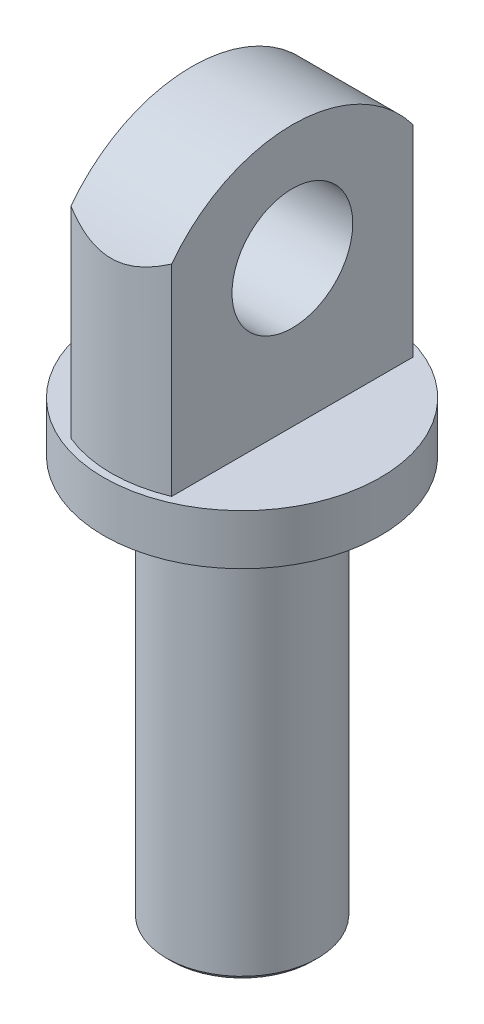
ISO-10303-21;
HEADER;
FILE_DESCRIPTION(('STEP AP214'),'2;1');
FILE_NAME('part.step','',(''),(''),'','','');
FILE_SCHEMA(('AUTOMOTIVE_DESIGN { 1 0 10303 214 1 1 1 1 }'));
ENDSEC;
DATA;
#1=APPLICATION_CONTEXT('core data for automotive mechanical design processes');
#2=APPLICATION_PROTOCOL_DEFINITION('international standard','automotive_design',2000,#1);
#3=PRODUCT_CONTEXT('',#1,'mechanical');
#4=PRODUCT('Part','Part','',(#3));
#5=PRODUCT_RELATED_PRODUCT_CATEGORY('part','',(#4));
#6=PRODUCT_DEFINITION_FORMATION('','',#4);
#7=PRODUCT_DEFINITION_CONTEXT('part definition',#1,'design');
#8=PRODUCT_DEFINITION('design','',#6,#7);
#9=PRODUCT_DEFINITION_SHAPE('','',#8);
#10=(LENGTH_UNIT() NAMED_UNIT(*) SI_UNIT(.MILLI.,.METRE.));
#11=(NAMED_UNIT(*) PLANE_ANGLE_UNIT() SI_UNIT($,.RADIAN.));
#12=(NAMED_UNIT(*) SI_UNIT($,.STERADIAN.) SOLID_ANGLE_UNIT());
#13=UNCERTAINTY_MEASURE_WITH_UNIT(LENGTH_MEASURE(1.E-05),#10,'distance_accuracy_value','');
#14=(GEOMETRIC_REPRESENTATION_CONTEXT(3) GLOBAL_UNCERTAINTY_ASSIGNED_CONTEXT((#13)) GLOBAL_UNIT_ASSIGNED_CONTEXT((#10,
#11,#12)) REPRESENTATION_CONTEXT('',''));
#15=CARTESIAN_POINT('',(0.,0.,0.));
#16=DIRECTION('',(0.,0.,1.));
#17=DIRECTION('',(1.,0.,0.));
#18=AXIS2_PLACEMENT_3D('',#15,#16,#17);
#19=CARTESIAN_POINT('',(0.,90.,0.));
#20=DIRECTION('',(0.,1.,0.));
#21=DIRECTION('',(0.,0.,1.));
#22=AXIS2_PLACEMENT_3D('',#19,#20,#21);
#23=PLANE('',#22);
#24=CARTESIAN_POINT('',(0.,90.,0.));
#25=DIRECTION('',(0.,1.,0.));
#26=DIRECTION('',(0.,0.,1.));
#27=AXIS2_PLACEMENT_3D('',#24,#25,#26);
#28=CIRCLE('',#27,27.5);
#29=CARTESIAN_POINT('',(0.,90.,27.5));
#30=VERTEX_POINT('',#29);
#31=EDGE_CURVE('E99',#30,#30,#28,.T.);
#32=ORIENTED_EDGE('',*,*,#31,.T.);
#33=EDGE_LOOP('',(#32));
#34=FACE_BOUND('',#33,.T.);
#35=DIRECTION('',(0.,0.,1.));
#36=VECTOR('',#35,1.);
#37=CARTESIAN_POINT('',(-9.99999999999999,90.,-24.));
#38=LINE('',#37,#36);
#39=CARTESIAN_POINT('',(-9.99999999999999,90.,-24.));
#40=VERTEX_POINT('',#39);
#41=CARTESIAN_POINT('',(-9.99999999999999,90.,24.));
#42=VERTEX_POINT('',#41);
#43=EDGE_CURVE('E247',#40,#42,#38,.T.);
#44=ORIENTED_EDGE('',*,*,#43,.F.);
#45=CARTESIAN_POINT('',(0.,90.,0.));
#46=DIRECTION('',(0.,1.,0.));
#47=DIRECTION('',(0.,0.,1.));
#48=AXIS2_PLACEMENT_3D('',#45,#46,#47);
#49=CIRCLE('',#48,26.);
#50=CARTESIAN_POINT('',(9.99999999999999,90.,-24.));
#51=VERTEX_POINT('',#50);
#52=EDGE_CURVE('E245',#51,#40,#49,.T.);
#53=ORIENTED_EDGE('',*,*,#52,.F.);
#54=DIRECTION('',(0.,0.,-1.));
#55=VECTOR('',#54,1.);
#56=CARTESIAN_POINT('',(9.99999999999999,90.,-24.));
#57=LINE('',#56,#55);
#58=CARTESIAN_POINT('',(9.99999999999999,90.,24.));
#59=VERTEX_POINT('',#58);
#60=EDGE_CURVE('E87',#59,#51,#57,.T.);
#61=ORIENTED_EDGE('',*,*,#60,.F.);
#62=CARTESIAN_POINT('',(0.,90.,0.));
#63=DIRECTION('',(0.,1.,0.));
#64=DIRECTION('',(0.,0.,1.));
#65=AXIS2_PLACEMENT_3D('',#62,#63,#64);
#66=CIRCLE('',#65,26.);
#67=EDGE_CURVE('E92',#42,#59,#66,.T.);
#68=ORIENTED_EDGE('',*,*,#67,.F.);
#69=EDGE_LOOP('',(#44,#53,#61,#68));
#70=FACE_BOUND('',#69,.T.);
#71=ADVANCED_FACE('F32',(#34,#70),#23,.T.);
#72=CARTESIAN_POINT('',(0.,80.,0.));
#73=DIRECTION('',(0.,-1.,0.));
#74=DIRECTION('',(0.,0.,-1.));
#75=AXIS2_PLACEMENT_3D('',#72,#73,#74);
#76=CYLINDRICAL_SURFACE('',#75,15.);
#77=CARTESIAN_POINT('',(0.,0.999999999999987,0.));
#78=DIRECTION('',(0.,1.,0.));
#79=DIRECTION('',(0.,0.,1.));
#80=AXIS2_PLACEMENT_3D('',#77,#78,#79);
#81=CIRCLE('',#80,15.);
#82=CARTESIAN_POINT('',(0.,0.999999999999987,15.));
#83=VERTEX_POINT('',#82);
#84=EDGE_CURVE('E40',#83,#83,#81,.T.);
#85=ORIENTED_EDGE('',*,*,#84,.T.);
#86=EDGE_LOOP('',(#85));
#87=FACE_BOUND('',#86,.T.);
#88=CARTESIAN_POINT('',(0.,80.,0.));
#89=DIRECTION('',(0.,1.,0.));
#90=DIRECTION('',(0.,0.,1.));
#91=AXIS2_PLACEMENT_3D('',#88,#89,#90);
#92=CIRCLE('',#91,15.);
#93=CARTESIAN_POINT('',(0.,80.,15.));
#94=VERTEX_POINT('',#93);
#95=EDGE_CURVE('E102',#94,#94,#92,.T.);
#96=ORIENTED_EDGE('',*,*,#95,.F.);
#97=EDGE_LOOP('',(#96));
#98=FACE_BOUND('',#97,.T.);
#99=ADVANCED_FACE('F109',(#87,#98),#76,.T.);
#100=CARTESIAN_POINT('',(0.,0.,0.));
#101=DIRECTION('',(0.,1.,0.));
#102=DIRECTION('',(0.,0.,1.));
#103=AXIS2_PLACEMENT_3D('',#100,#101,#102);
#104=PLANE('',#103);
#105=CARTESIAN_POINT('',(0.,0.,0.));
#106=DIRECTION('',(0.,1.,0.));
#107=DIRECTION('',(0.,0.,1.));
#108=AXIS2_PLACEMENT_3D('',#105,#106,#107);
#109=CIRCLE('',#108,14.);
#110=CARTESIAN_POINT('',(0.,0.,14.));
#111=VERTEX_POINT('',#110);
#112=EDGE_CURVE('E11',#111,#111,#109,.F.);
#113=ORIENTED_EDGE('',*,*,#112,.T.);
#114=EDGE_LOOP('',(#113));
#115=FACE_BOUND('',#114,.T.);
#116=ADVANCED_FACE('F126',(#115),#104,.F.);
#117=CARTESIAN_POINT('',(0.,80.,0.));
#118=DIRECTION('',(0.,1.,0.));
#119=DIRECTION('',(0.,0.,1.));
#120=AXIS2_PLACEMENT_3D('',#117,#118,#119);
#121=PLANE('',#120);
#122=CARTESIAN_POINT('',(0.,80.,0.));
#123=DIRECTION('',(0.,1.,0.));
#124=DIRECTION('',(0.,0.,1.));
#125=AXIS2_PLACEMENT_3D('',#122,#123,#124);
#126=CIRCLE('',#125,27.5);
#127=CARTESIAN_POINT('',(0.,80.,27.5));
#128=VERTEX_POINT('',#127);
#129=EDGE_CURVE('E98',#128,#128,#126,.T.);
#130=ORIENTED_EDGE('',*,*,#129,.F.);
#131=EDGE_LOOP('',(#130));
#132=FACE_BOUND('',#131,.T.);
#133=ORIENTED_EDGE('',*,*,#95,.T.);
#134=EDGE_LOOP('',(#133));
#135=FACE_BOUND('',#134,.T.);
#136=ADVANCED_FACE('F132',(#132,#135),#121,.F.);
#137=CARTESIAN_POINT('',(0.,90.,0.));
#138=DIRECTION('',(0.,-1.,0.));
#139=DIRECTION('',(0.,0.,-1.));
#140=AXIS2_PLACEMENT_3D('',#137,#138,#139);
#141=CYLINDRICAL_SURFACE('',#140,27.5);
#142=ORIENTED_EDGE('',*,*,#31,.F.);
#143=EDGE_LOOP('',(#142));
#144=FACE_BOUND('',#143,.T.);
#145=ORIENTED_EDGE('',*,*,#129,.T.);
#146=EDGE_LOOP('',(#145));
#147=FACE_BOUND('',#146,.T.);
#148=ADVANCED_FACE('F135',(#144,#147),#141,.T.);
#149=CARTESIAN_POINT('',(0.,142.,0.));
#150=DIRECTION('',(0.,-1.,0.));
#151=DIRECTION('',(0.,0.,-1.));
#152=AXIS2_PLACEMENT_3D('',#149,#150,#151);
#153=CYLINDRICAL_SURFACE('',#152,26.);
#154=DIRECTION('',(0.,-1.,0.));
#155=VECTOR('',#154,1.);
#156=CARTESIAN_POINT('',(-9.99999999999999,142.,-24.));
#157=LINE('',#156,#155);
#158=CARTESIAN_POINT('',(-10.,130.,-24.));
#159=VERTEX_POINT('',#158);
#160=EDGE_CURVE('E80',#159,#40,#157,.T.);
#161=ORIENTED_EDGE('',*,*,#160,.F.);
#162=CARTESIAN_POINT('',(-9.99999999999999,130.,-24.));
#163=CARTESIAN_POINT('',(-9.61721305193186,129.78746030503,-24.1594549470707));
#164=CARTESIAN_POINT('',(-9.22821241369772,129.579676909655,-24.3108286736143));
#165=CARTESIAN_POINT('',(-8.43659301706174,129.1772698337,-24.5967847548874));
#166=CARTESIAN_POINT('',(-8.03395311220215,128.982668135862,-24.7313393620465));
#167=CARTESIAN_POINT('',(-7.20815781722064,128.607835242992,-24.9846349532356));
#168=CARTESIAN_POINT('',(-6.78477019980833,128.427904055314,-25.1030687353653));
#169=CARTESIAN_POINT('',(-5.92395259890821,128.091499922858,-25.3200248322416));
#170=CARTESIAN_POINT('',(-5.48653042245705,127.935014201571,-25.4185580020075));
#171=CARTESIAN_POINT('',(-4.66663132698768,127.673251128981,-25.580640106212));
#172=CARTESIAN_POINT('',(-4.28609931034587,127.563797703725,-25.6472416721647));
#173=CARTESIAN_POINT('',(-3.51622672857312,127.369619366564,-25.7640772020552));
#174=CARTESIAN_POINT('',(-3.12688633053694,127.284893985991,-25.8143114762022));
#175=CARTESIAN_POINT('',(-2.344485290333,127.144300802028,-25.8970422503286));
#176=CARTESIAN_POINT('',(-1.95148261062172,127.088198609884,-25.9296829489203));
#177=CARTESIAN_POINT('',(-1.16122908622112,127.006468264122,-25.9770702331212));
#178=CARTESIAN_POINT('',(-0.763978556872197,126.980837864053,-25.9918181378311));
#179=CARTESIAN_POINT('',(0.0331704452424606,126.961341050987,-26.0030462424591));
#180=CARTESIAN_POINT('',(0.43307314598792,126.967602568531,-25.9994528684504));
#181=CARTESIAN_POINT('',(1.2305214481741,127.01184951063,-25.9739292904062));
#182=CARTESIAN_POINT('',(1.62806691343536,127.049836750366,-25.9519980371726));
#183=CARTESIAN_POINT('',(2.42115179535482,127.156059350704,-25.890106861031));
#184=CARTESIAN_POINT('',(2.81664386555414,127.224554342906,-25.849992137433));
#185=CARTESIAN_POINT('',(3.59971643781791,127.388672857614,-25.7526271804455));
#186=CARTESIAN_POINT('',(3.9872967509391,127.484297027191,-25.6953765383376));
#187=CARTESIAN_POINT('',(4.87800387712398,127.733953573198,-25.5435000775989));
#188=CARTESIAN_POINT('',(5.3775986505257,127.896864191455,-25.4427743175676));
#189=CARTESIAN_POINT('',(6.35922069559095,128.255164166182,-25.2153649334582));
#190=CARTESIAN_POINT('',(6.84122952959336,128.450586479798,-25.0886549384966));
#191=CARTESIAN_POINT('',(7.77934610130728,128.862491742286,-24.8136379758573));
#192=CARTESIAN_POINT('',(8.23575378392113,129.078563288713,-24.6657318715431));
#193=CARTESIAN_POINT('',(8.90724657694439,129.415560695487,-24.4277945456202));
#194=CARTESIAN_POINT('',(9.1286234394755,129.529891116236,-24.3459143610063));
#195=CARTESIAN_POINT('',(9.56731334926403,129.762290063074,-24.1768838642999));
#196=CARTESIAN_POINT('',(9.78462710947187,129.880357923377,-24.0897344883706));
#197=CARTESIAN_POINT('',(9.99999999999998,130.,-24.));
#198=B_SPLINE_CURVE_WITH_KNOTS('',3,(#162,#163,#164,#165,#166,#167,#168,#169,#170,#171,#172,
#173,#174,#175,#176,#177,#178,#179,#180,#181,#182,#183,#184,#185,#186,#187,#188,#189,#190,#191,
#192,#193,#194,#195,#196,#197),.UNSPECIFIED.,.F.,.F.,(4,2,2,2,2,2,2,2,2,2,2,2,2,2,2,2,2,4),(0.,
1.39801943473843,2.7983156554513,4.22238146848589,5.6456683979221,6.84918942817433,
8.0526876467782,9.24616580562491,10.4395559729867,11.6377370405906,12.8359866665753,
14.0446346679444,15.2533114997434,16.8561025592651,18.460528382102,20.0378589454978,
20.8245668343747,21.611135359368),.UNSPECIFIED.);
#199=CARTESIAN_POINT('',(9.99999999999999,130.,-24.));
#200=VERTEX_POINT('',#199);
#201=EDGE_CURVE('E75',#159,#200,#198,.T.);
#202=ORIENTED_EDGE('',*,*,#201,.T.);
#203=DIRECTION('',(0.,-1.,0.));
#204=VECTOR('',#203,1.);
#205=CARTESIAN_POINT('',(9.99999999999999,142.,-24.));
#206=LINE('',#205,#204);
#207=EDGE_CURVE('E79',#200,#51,#206,.T.);
#208=ORIENTED_EDGE('',*,*,#207,.T.);
#209=ORIENTED_EDGE('',*,*,#52,.T.);
#210=EDGE_LOOP('',(#161,#202,#208,#209));
#211=FACE_BOUND('',#210,.T.);
#212=ADVANCED_FACE('F76',(#211),#153,.T.);
#213=CARTESIAN_POINT('',(-9.99999999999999,142.,-24.));
#214=DIRECTION('',(1.,0.,0.));
#215=DIRECTION('',(0.,0.,-1.));
#216=AXIS2_PLACEMENT_3D('',#213,#214,#215);
#217=PLANE('',#216);
#218=CARTESIAN_POINT('',(-10.,119.,0.));
#219=DIRECTION('',(1.,0.,0.));
#220=DIRECTION('',(0.,0.,-1.));
#221=AXIS2_PLACEMENT_3D('',#218,#219,#220);
#222=CIRCLE('',#221,12.);
#223=CARTESIAN_POINT('',(-10.,119.,-12.));
#224=VERTEX_POINT('',#223);
#225=EDGE_CURVE('E242',#224,#224,#222,.T.);
#226=ORIENTED_EDGE('',*,*,#225,.T.);
#227=EDGE_LOOP('',(#226));
#228=FACE_BOUND('',#227,.T.);
#229=DIRECTION('',(0.,-1.,0.));
#230=VECTOR('',#229,1.);
#231=CARTESIAN_POINT('',(-9.99999999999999,142.,24.));
#232=LINE('',#231,#230);
#233=CARTESIAN_POINT('',(-9.99999999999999,130.,24.));
#234=VERTEX_POINT('',#233);
#235=EDGE_CURVE('E90',#234,#42,#232,.T.);
#236=ORIENTED_EDGE('',*,*,#235,.F.);
#237=CARTESIAN_POINT('',(-10.,112.,0.));
#238=DIRECTION('',(1.,0.,0.));
#239=DIRECTION('',(0.,0.,-1.));
#240=AXIS2_PLACEMENT_3D('',#237,#238,#239);
#241=CIRCLE('',#240,30.);
#242=EDGE_CURVE('E235',#234,#159,#241,.F.);
#243=ORIENTED_EDGE('',*,*,#242,.T.);
#244=ORIENTED_EDGE('',*,*,#160,.T.);
#245=ORIENTED_EDGE('',*,*,#43,.T.);
#246=EDGE_LOOP('',(#236,#243,#244,#245));
#247=FACE_BOUND('',#246,.T.);
#248=ADVANCED_FACE('F161',(#228,#247),#217,.F.);
#249=CARTESIAN_POINT('',(0.,142.,0.));
#250=DIRECTION('',(0.,-1.,0.));
#251=DIRECTION('',(0.,0.,-1.));
#252=AXIS2_PLACEMENT_3D('',#249,#250,#251);
#253=CYLINDRICAL_SURFACE('',#252,26.);
#254=DIRECTION('',(0.,-1.,0.));
#255=VECTOR('',#254,1.);
#256=CARTESIAN_POINT('',(9.99999999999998,142.,24.));
#257=LINE('',#256,#255);
#258=CARTESIAN_POINT('',(9.99999999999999,130.,24.));
#259=VERTEX_POINT('',#258);
#260=EDGE_CURVE('E54',#259,#59,#257,.T.);
#261=ORIENTED_EDGE('',*,*,#260,.F.);
#262=CARTESIAN_POINT('',(9.99999999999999,130.,24.));
#263=CARTESIAN_POINT('',(9.61721305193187,129.78746030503,24.1594549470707));
#264=CARTESIAN_POINT('',(9.22821241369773,129.579676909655,24.3108286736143));
#265=CARTESIAN_POINT('',(8.43659301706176,129.1772698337,24.5967847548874));
#266=CARTESIAN_POINT('',(8.03395311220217,128.982668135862,24.7313393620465));
#267=CARTESIAN_POINT('',(7.20815781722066,128.607835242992,24.9846349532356));
#268=CARTESIAN_POINT('',(6.78477019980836,128.427904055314,25.1030687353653));
#269=CARTESIAN_POINT('',(5.92395259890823,128.091499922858,25.3200248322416));
#270=CARTESIAN_POINT('',(5.48653042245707,127.935014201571,25.4185580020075));
#271=CARTESIAN_POINT('',(4.66663132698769,127.673251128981,25.580640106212));
#272=CARTESIAN_POINT('',(4.28609931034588,127.563797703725,25.6472416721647));
#273=CARTESIAN_POINT('',(3.51622672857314,127.369619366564,25.7640772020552));
#274=CARTESIAN_POINT('',(3.12688633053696,127.284893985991,25.8143114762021));
#275=CARTESIAN_POINT('',(2.34448529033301,127.144300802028,25.8970422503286));
#276=CARTESIAN_POINT('',(1.95148261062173,127.088198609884,25.9296829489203));
#277=CARTESIAN_POINT('',(1.16122908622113,127.006468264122,25.9770702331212));
#278=CARTESIAN_POINT('',(0.763978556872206,126.980837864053,25.9918181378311));
#279=CARTESIAN_POINT('',(-0.0331704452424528,126.961341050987,26.0030462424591));
#280=CARTESIAN_POINT('',(-0.433073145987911,126.967602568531,25.9994528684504));
#281=CARTESIAN_POINT('',(-1.23052144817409,127.01184951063,25.9739292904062));
#282=CARTESIAN_POINT('',(-1.62806691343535,127.049836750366,25.9519980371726));
#283=CARTESIAN_POINT('',(-2.42115179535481,127.156059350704,25.890106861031));
#284=CARTESIAN_POINT('',(-2.81664386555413,127.224554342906,25.849992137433));
#285=CARTESIAN_POINT('',(-3.5997164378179,127.388672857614,25.7526271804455));
#286=CARTESIAN_POINT('',(-3.98729675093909,127.484297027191,25.6953765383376));
#287=CARTESIAN_POINT('',(-4.87800387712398,127.733953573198,25.5435000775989));
#288=CARTESIAN_POINT('',(-5.37759865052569,127.896864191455,25.4427743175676));
#289=CARTESIAN_POINT('',(-6.35922069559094,128.255164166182,25.2153649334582));
#290=CARTESIAN_POINT('',(-6.84122952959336,128.450586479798,25.0886549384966));
#291=CARTESIAN_POINT('',(-7.77934610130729,128.862491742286,24.8136379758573));
#292=CARTESIAN_POINT('',(-8.23575378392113,129.078563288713,24.6657318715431));
#293=CARTESIAN_POINT('',(-8.90724657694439,129.415560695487,24.4277945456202));
#294=CARTESIAN_POINT('',(-9.1286234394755,129.529891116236,24.3459143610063));
#295=CARTESIAN_POINT('',(-9.56731334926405,129.762290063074,24.1768838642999));
#296=CARTESIAN_POINT('',(-9.78462710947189,129.880357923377,24.0897344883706));
#297=CARTESIAN_POINT('',(-9.99999999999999,130.,24.));
#298=B_SPLINE_CURVE_WITH_KNOTS('',3,(#262,#263,#264,#265,#266,#267,#268,#269,#270,#271,#272,
#273,#274,#275,#276,#277,#278,#279,#280,#281,#282,#283,#284,#285,#286,#287,#288,#289,#290,#291,
#292,#293,#294,#295,#296,#297),.UNSPECIFIED.,.F.,.F.,(4,2,2,2,2,2,2,2,2,2,2,2,2,2,2,2,2,4),(0.,
1.39801943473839,2.79831565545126,4.22238146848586,5.64566839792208,6.8491894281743,
8.05268764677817,9.2461658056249,10.4395559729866,11.6377370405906,12.8359866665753,
14.0446346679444,15.2533114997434,16.8561025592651,18.460528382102,20.0378589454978,
20.8245668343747,21.611135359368),.UNSPECIFIED.);
#299=EDGE_CURVE('E47',#259,#234,#298,.T.);
#300=ORIENTED_EDGE('',*,*,#299,.T.);
#301=ORIENTED_EDGE('',*,*,#235,.T.);
#302=ORIENTED_EDGE('',*,*,#67,.T.);
#303=EDGE_LOOP('',(#261,#300,#301,#302));
#304=FACE_BOUND('',#303,.T.);
#305=ADVANCED_FACE('F167',(#304),#253,.T.);
#306=CARTESIAN_POINT('',(9.99999999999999,142.,-24.));
#307=DIRECTION('',(-1.,0.,0.));
#308=DIRECTION('',(0.,0.,1.));
#309=AXIS2_PLACEMENT_3D('',#306,#307,#308);
#310=PLANE('',#309);
#311=CARTESIAN_POINT('',(9.99999999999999,119.,0.));
#312=DIRECTION('',(1.,0.,0.));
#313=DIRECTION('',(0.,0.,-1.));
#314=AXIS2_PLACEMENT_3D('',#311,#312,#313);
#315=CIRCLE('',#314,12.);
#316=CARTESIAN_POINT('',(9.99999999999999,119.,-12.));
#317=VERTEX_POINT('',#316);
#318=EDGE_CURVE('E240',#317,#317,#315,.T.);
#319=ORIENTED_EDGE('',*,*,#318,.F.);
#320=EDGE_LOOP('',(#319));
#321=FACE_BOUND('',#320,.T.);
#322=ORIENTED_EDGE('',*,*,#207,.F.);
#323=CARTESIAN_POINT('',(9.99999999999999,112.,0.));
#324=DIRECTION('',(-1.,0.,0.));
#325=DIRECTION('',(0.,0.,1.));
#326=AXIS2_PLACEMENT_3D('',#323,#324,#325);
#327=CIRCLE('',#326,30.);
#328=EDGE_CURVE('E81',#259,#200,#327,.T.);
#329=ORIENTED_EDGE('',*,*,#328,.F.);
#330=ORIENTED_EDGE('',*,*,#260,.T.);
#331=ORIENTED_EDGE('',*,*,#60,.T.);
#332=EDGE_LOOP('',(#322,#329,#330,#331));
#333=FACE_BOUND('',#332,.T.);
#334=ADVANCED_FACE('F85',(#321,#333),#310,.F.);
#335=CARTESIAN_POINT('',(-42.,119.,0.));
#336=DIRECTION('',(1.,0.,0.));
#337=DIRECTION('',(0.,0.,-1.));
#338=AXIS2_PLACEMENT_3D('',#335,#336,#337);
#339=CYLINDRICAL_SURFACE('',#338,12.);
#340=CARTESIAN_POINT('',(9.99999999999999,119.,-12.));
#341=CARTESIAN_POINT('',(9.79166666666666,119.,-12.));
#342=CARTESIAN_POINT('',(9.58333333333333,119.,-12.));
#343=CARTESIAN_POINT('',(9.16666666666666,119.,-12.));
#344=CARTESIAN_POINT('',(8.95833333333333,119.,-12.));
#345=CARTESIAN_POINT('',(8.54166666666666,119.,-12.));
#346=CARTESIAN_POINT('',(8.33333333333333,119.,-12.));
#347=CARTESIAN_POINT('',(7.91666666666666,119.,-12.));
#348=CARTESIAN_POINT('',(7.70833333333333,119.,-12.));
#349=CARTESIAN_POINT('',(7.29166666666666,119.,-12.));
#350=CARTESIAN_POINT('',(7.08333333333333,119.,-12.));
#351=CARTESIAN_POINT('',(6.66666666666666,119.,-12.));
#352=CARTESIAN_POINT('',(6.45833333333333,119.,-12.));
#353=CARTESIAN_POINT('',(6.04166666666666,119.,-12.));
#354=CARTESIAN_POINT('',(5.83333333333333,119.,-12.));
#355=CARTESIAN_POINT('',(5.41666666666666,119.,-12.));
#356=CARTESIAN_POINT('',(5.20833333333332,119.,-12.));
#357=CARTESIAN_POINT('',(4.79166666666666,119.,-12.));
#358=CARTESIAN_POINT('',(4.58333333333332,119.,-12.));
#359=CARTESIAN_POINT('',(4.16666666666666,119.,-12.));
#360=CARTESIAN_POINT('',(3.95833333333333,119.,-12.));
#361=CARTESIAN_POINT('',(3.54166666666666,119.,-12.));
#362=CARTESIAN_POINT('',(3.33333333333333,119.,-12.));
#363=CARTESIAN_POINT('',(2.91666666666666,119.,-12.));
#364=CARTESIAN_POINT('',(2.70833333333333,119.,-12.));
#365=CARTESIAN_POINT('',(2.29166666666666,119.,-12.));
#366=CARTESIAN_POINT('',(2.08333333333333,119.,-12.));
#367=CARTESIAN_POINT('',(1.66666666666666,119.,-12.));
#368=CARTESIAN_POINT('',(1.45833333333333,119.,-12.));
#369=CARTESIAN_POINT('',(1.04166666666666,119.,-12.));
#370=CARTESIAN_POINT('',(0.833333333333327,119.,-12.));
#371=CARTESIAN_POINT('',(0.41666666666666,119.,-12.));
#372=CARTESIAN_POINT('',(0.208333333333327,119.,-12.));
#373=CARTESIAN_POINT('',(-0.20833333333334,119.,-12.));
#374=CARTESIAN_POINT('',(-0.416666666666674,119.,-12.));
#375=CARTESIAN_POINT('',(-0.833333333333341,119.,-12.));
#376=CARTESIAN_POINT('',(-1.04166666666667,119.,-12.));
#377=CARTESIAN_POINT('',(-1.45833333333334,119.,-12.));
#378=CARTESIAN_POINT('',(-1.66666666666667,119.,-12.));
#379=CARTESIAN_POINT('',(-2.08333333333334,119.,-12.));
#380=CARTESIAN_POINT('',(-2.29166666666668,119.,-12.));
#381=CARTESIAN_POINT('',(-2.70833333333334,119.,-12.));
#382=CARTESIAN_POINT('',(-2.91666666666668,119.,-12.));
#383=CARTESIAN_POINT('',(-3.33333333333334,119.,-12.));
#384=CARTESIAN_POINT('',(-3.54166666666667,119.,-12.));
#385=CARTESIAN_POINT('',(-3.95833333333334,119.,-12.));
#386=CARTESIAN_POINT('',(-4.16666666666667,119.,-12.));
#387=CARTESIAN_POINT('',(-4.58333333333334,119.,-12.));
#388=CARTESIAN_POINT('',(-4.79166666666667,119.,-12.));
#389=CARTESIAN_POINT('',(-5.20833333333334,119.,-12.));
#390=CARTESIAN_POINT('',(-5.41666666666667,119.,-12.));
#391=CARTESIAN_POINT('',(-5.83333333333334,119.,-12.));
#392=CARTESIAN_POINT('',(-6.04166666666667,119.,-12.));
#393=CARTESIAN_POINT('',(-6.45833333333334,119.,-12.));
#394=CARTESIAN_POINT('',(-6.66666666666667,119.,-12.));
#395=CARTESIAN_POINT('',(-7.08333333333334,119.,-12.));
#396=CARTESIAN_POINT('',(-7.29166666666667,119.,-12.));
#397=CARTESIAN_POINT('',(-7.70833333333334,119.,-12.));
#398=CARTESIAN_POINT('',(-7.91666666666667,119.,-12.));
#399=CARTESIAN_POINT('',(-8.33333333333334,119.,-12.));
#400=CARTESIAN_POINT('',(-8.54166666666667,119.,-12.));
#401=CARTESIAN_POINT('',(-8.95833333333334,119.,-12.));
#402=CARTESIAN_POINT('',(-9.16666666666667,119.,-12.));
#403=CARTESIAN_POINT('',(-9.58333333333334,119.,-12.));
#404=CARTESIAN_POINT('',(-9.79166666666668,119.,-12.));
#405=CARTESIAN_POINT('',(-10.,119.,-12.));
#406=B_SPLINE_CURVE_WITH_KNOTS('',3,(#340,#341,#342,#343,#344,#345,#346,#347,#348,#349,#350,
#351,#352,#353,#354,#355,#356,#357,#358,#359,#360,#361,#362,#363,#364,#365,#366,#367,#368,#369,
#370,#371,#372,#373,#374,#375,#376,#377,#378,#379,#380,#381,#382,#383,#384,#385,#386,#387,#388,
#389,#390,#391,#392,#393,#394,#395,#396,#397,#398,#399,#400,#401,#402,#403,#404,#405),
.UNSPECIFIED.,.F.,.F.,(4,2,2,2,2,2,2,2,2,2,2,2,2,2,2,2,2,2,2,2,2,2,2,2,2,2,2,2,2,2,2,2,4),(0.,
0.625000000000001,1.25,1.875,2.5,3.125,3.75,4.375,5.,5.62500000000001,6.25,6.875,7.5,8.125,8.75,
9.375,10.,10.625,11.25,11.875,12.5,13.125,13.75,14.375,15.,15.625,16.25,16.875,17.5,18.125,
18.75,19.375,20.),.UNSPECIFIED.);
#407=EDGE_CURVE('BSEAM117',#317,#224,#406,.T.);
#408=ORIENTED_EDGE('',*,*,#318,.T.);
#409=ORIENTED_EDGE('',*,*,#225,.F.);
#410=ORIENTED_EDGE('',*,*,#407,.T.);
#411=ORIENTED_EDGE('',*,*,#407,.F.);
#412=EDGE_LOOP('',(#408,#410,#409,#411));
#413=FACE_BOUND('',#412,.T.);
#414=ADVANCED_FACE('F117',(#413),#339,.F.);
#415=CARTESIAN_POINT('',(-42.,112.,0.));
#416=DIRECTION('',(1.,0.,0.));
#417=DIRECTION('',(0.,0.,-1.));
#418=AXIS2_PLACEMENT_3D('',#415,#416,#417);
#419=CYLINDRICAL_SURFACE('',#418,30.);
#420=ORIENTED_EDGE('',*,*,#299,.F.);
#421=ORIENTED_EDGE('',*,*,#328,.T.);
#422=ORIENTED_EDGE('',*,*,#201,.F.);
#423=ORIENTED_EDGE('',*,*,#242,.F.);
#424=EDGE_LOOP('',(#420,#421,#422,#423));
#425=FACE_BOUND('',#424,.T.);
#426=ADVANCED_FACE('F83',(#425),#419,.T.);
#427=CARTESIAN_POINT('',(0.,0.999999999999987,0.));
#428=DIRECTION('',(0.,1.,0.));
#429=DIRECTION('',(0.,0.,1.));
#430=AXIS2_PLACEMENT_3D('',#427,#428,#429);
#431=CONICAL_SURFACE('',#430,15.,0.785398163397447);
#432=ORIENTED_EDGE('',*,*,#112,.F.);
#433=EDGE_LOOP('',(#432));
#434=FACE_BOUND('',#433,.T.);
#435=ORIENTED_EDGE('',*,*,#84,.F.);
#436=EDGE_LOOP('',(#435));
#437=FACE_BOUND('',#436,.T.);
#438=ADVANCED_FACE('F34',(#434,#437),#431,.T.);
#439=CLOSED_SHELL('',(#71,#99,#116,#136,#148,#212,#248,#305,#334,#414,#426,#438));
#440=MANIFOLD_SOLID_BREP('B2',#439);
#441=ADVANCED_BREP_SHAPE_REPRESENTATION('',(#18,#440),#14);
#442=SHAPE_DEFINITION_REPRESENTATION(#9,#441);
ENDSEC;
END-ISO-10303-21;
